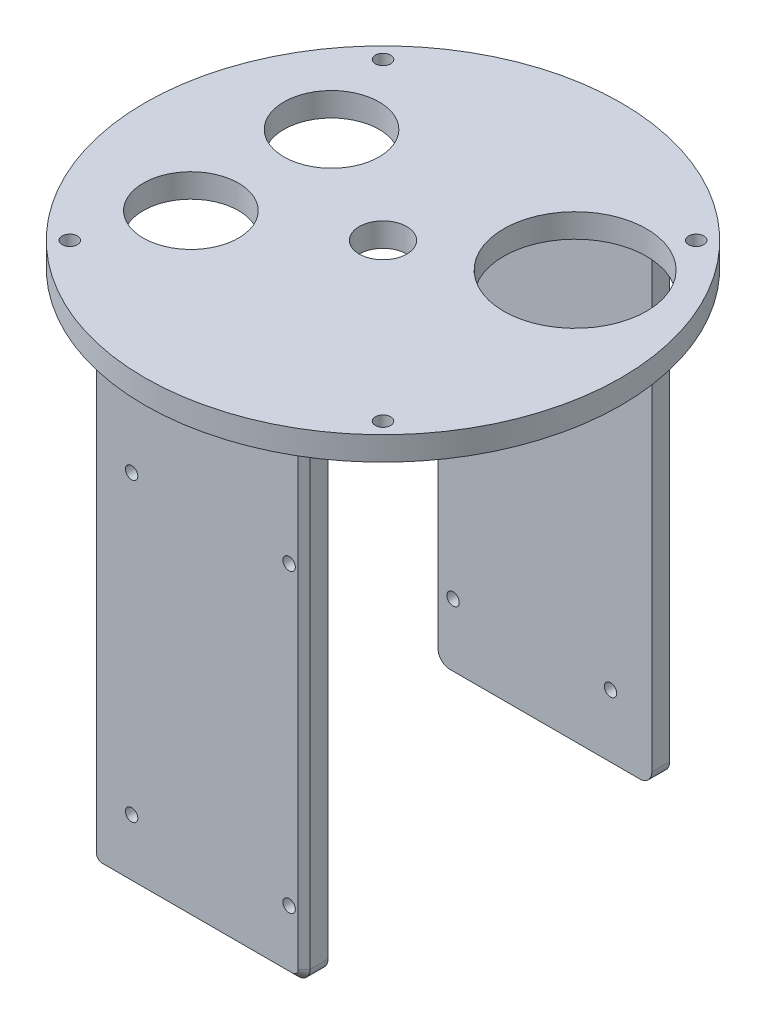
ISO-10303-21;
HEADER;
FILE_DESCRIPTION(('STEP AP214'),'2;1');
FILE_NAME('part.step','',(''),(''),'','','');
FILE_SCHEMA(('AUTOMOTIVE_DESIGN { 1 0 10303 214 1 1 1 1 }'));
ENDSEC;
DATA;
#1=APPLICATION_CONTEXT('core data for automotive mechanical design processes');
#2=APPLICATION_PROTOCOL_DEFINITION('international standard','automotive_design',2000,#1);
#3=PRODUCT_CONTEXT('',#1,'mechanical');
#4=PRODUCT('Part','Part','',(#3));
#5=PRODUCT_RELATED_PRODUCT_CATEGORY('part','',(#4));
#6=PRODUCT_DEFINITION_FORMATION('','',#4);
#7=PRODUCT_DEFINITION_CONTEXT('part definition',#1,'design');
#8=PRODUCT_DEFINITION('design','',#6,#7);
#9=PRODUCT_DEFINITION_SHAPE('','',#8);
#10=(LENGTH_UNIT() NAMED_UNIT(*) SI_UNIT(.MILLI.,.METRE.));
#11=(NAMED_UNIT(*) PLANE_ANGLE_UNIT() SI_UNIT($,.RADIAN.));
#12=(NAMED_UNIT(*) SI_UNIT($,.STERADIAN.) SOLID_ANGLE_UNIT());
#13=UNCERTAINTY_MEASURE_WITH_UNIT(LENGTH_MEASURE(1.E-05),#10,'distance_accuracy_value','');
#14=(GEOMETRIC_REPRESENTATION_CONTEXT(3) GLOBAL_UNCERTAINTY_ASSIGNED_CONTEXT((#13)) GLOBAL_UNIT_ASSIGNED_CONTEXT((#10,
#11,#12)) REPRESENTATION_CONTEXT('',''));
#15=CARTESIAN_POINT('',(0.,0.,0.));
#16=DIRECTION('',(0.,0.,1.));
#17=DIRECTION('',(1.,0.,0.));
#18=AXIS2_PLACEMENT_3D('',#15,#16,#17);
#19=CARTESIAN_POINT('',(32.5538959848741,73.8599908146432,103.618976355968));
#20=DIRECTION('',(0.,1.,0.));
#21=DIRECTION('',(0.,0.,1.));
#22=AXIS2_PLACEMENT_3D('',#19,#20,#21);
#23=PLANE('',#22);
#24=CARTESIAN_POINT('',(32.5538959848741,73.8599908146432,103.618976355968));
#25=DIRECTION('',(0.,1.,0.));
#26=DIRECTION('',(0.,0.,1.));
#27=AXIS2_PLACEMENT_3D('',#24,#25,#26);
#28=CIRCLE('',#27,6.35);
#29=CARTESIAN_POINT('',(32.5538959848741,73.8599908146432,109.968976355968));
#30=VERTEX_POINT('',#29);
#31=EDGE_CURVE('P0_E69',#30,#30,#28,.T.);
#32=ORIENTED_EDGE('',*,*,#31,.F.);
#33=EDGE_LOOP('',(#32));
#34=FACE_BOUND('',#33,.T.);
#35=CARTESIAN_POINT('',(0.0779433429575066,73.8599908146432,122.368976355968));
#36=DIRECTION('',(0.,1.,0.));
#37=DIRECTION('',(0.,0.,1.));
#38=AXIS2_PLACEMENT_3D('',#35,#36,#37);
#39=CIRCLE('',#38,12.7);
#40=CARTESIAN_POINT('',(0.0779433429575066,73.8599908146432,135.068976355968));
#41=VERTEX_POINT('',#40);
#42=EDGE_CURVE('P0_E37',#41,#41,#39,.T.);
#43=ORIENTED_EDGE('',*,*,#42,.F.);
#44=EDGE_LOOP('',(#43));
#45=FACE_BOUND('',#44,.T.);
#46=CARTESIAN_POINT('',(65.0298486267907,73.8599908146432,84.8689763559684));
#47=DIRECTION('',(0.,1.,0.));
#48=DIRECTION('',(0.,0.,1.));
#49=AXIS2_PLACEMENT_3D('',#46,#47,#48);
#50=CIRCLE('',#49,19.05);
#51=CARTESIAN_POINT('',(65.0298486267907,73.8599908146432,103.918976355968));
#52=VERTEX_POINT('',#51);
#53=EDGE_CURVE('P0_E36',#52,#52,#50,.T.);
#54=ORIENTED_EDGE('',*,*,#53,.F.);
#55=EDGE_LOOP('',(#54));
#56=FACE_BOUND('',#55,.T.);
#57=CARTESIAN_POINT('',(0.0779433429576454,73.8599908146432,84.8689763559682));
#58=DIRECTION('',(0.,1.,0.));
#59=DIRECTION('',(0.,0.,1.));
#60=AXIS2_PLACEMENT_3D('',#57,#58,#59);
#61=CIRCLE('',#60,12.7);
#62=CARTESIAN_POINT('',(0.0779433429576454,73.8599908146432,97.5689763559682));
#63=VERTEX_POINT('',#62);
#64=EDGE_CURVE('P0_E30',#63,#63,#61,.T.);
#65=ORIENTED_EDGE('',*,*,#64,.F.);
#66=EDGE_LOOP('',(#65));
#67=FACE_BOUND('',#66,.T.);
#68=CARTESIAN_POINT('',(74.3120869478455,73.8599908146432,145.37716731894));
#69=DIRECTION('',(0.,1.,0.));
#70=DIRECTION('',(0.,0.,1.));
#71=AXIS2_PLACEMENT_3D('',#68,#69,#70);
#72=CIRCLE('',#71,2.032);
#73=CARTESIAN_POINT('',(74.3120869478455,73.8599908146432,147.40916731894));
#74=VERTEX_POINT('',#73);
#75=EDGE_CURVE('P0_E48',#74,#74,#72,.T.);
#76=ORIENTED_EDGE('',*,*,#75,.F.);
#77=EDGE_LOOP('',(#76));
#78=FACE_BOUND('',#77,.T.);
#79=CARTESIAN_POINT('',(-9.20429497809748,73.8599908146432,61.8607853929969));
#80=DIRECTION('',(0.,-1.,0.));
#81=DIRECTION('',(0.,0.,-1.));
#82=AXIS2_PLACEMENT_3D('',#79,#80,#81);
#83=CIRCLE('',#82,2.032);
#84=CARTESIAN_POINT('',(-9.20429497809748,73.8599908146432,59.8287853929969));
#85=VERTEX_POINT('',#84);
#86=EDGE_CURVE('P0_E54',#85,#85,#83,.T.);
#87=ORIENTED_EDGE('',*,*,#86,.T.);
#88=EDGE_LOOP('',(#87));
#89=FACE_BOUND('',#88,.T.);
#90=CARTESIAN_POINT('',(74.3120869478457,73.8599908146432,61.8607853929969));
#91=DIRECTION('',(0.,1.,0.));
#92=DIRECTION('',(0.,0.,1.));
#93=AXIS2_PLACEMENT_3D('',#90,#91,#92);
#94=CIRCLE('',#93,2.032);
#95=CARTESIAN_POINT('',(74.3120869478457,73.8599908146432,63.8927853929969));
#96=VERTEX_POINT('',#95);
#97=EDGE_CURVE('P0_E27',#96,#96,#94,.T.);
#98=ORIENTED_EDGE('',*,*,#97,.F.);
#99=EDGE_LOOP('',(#98));
#100=FACE_BOUND('',#99,.T.);
#101=CARTESIAN_POINT('',(32.5538959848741,73.8599908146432,103.618976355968));
#102=DIRECTION('',(0.,1.,0.));
#103=DIRECTION('',(0.,0.,1.));
#104=AXIS2_PLACEMENT_3D('',#101,#102,#103);
#105=CIRCLE('',#104,63.5);
#106=CARTESIAN_POINT('',(32.5538959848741,73.8599908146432,167.118976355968));
#107=VERTEX_POINT('',#106);
#108=EDGE_CURVE('P0_E10',#107,#107,#105,.T.);
#109=ORIENTED_EDGE('',*,*,#108,.T.);
#110=EDGE_LOOP('',(#109));
#111=FACE_BOUND('',#110,.T.);
#112=CARTESIAN_POINT('',(-9.20429497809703,73.8599908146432,145.37716731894));
#113=DIRECTION('',(0.,1.,0.));
#114=DIRECTION('',(0.,0.,1.));
#115=AXIS2_PLACEMENT_3D('',#112,#113,#114);
#116=CIRCLE('',#115,2.03199999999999);
#117=CARTESIAN_POINT('',(-9.20429497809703,73.8599908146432,147.40916731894));
#118=VERTEX_POINT('',#117);
#119=EDGE_CURVE('P0_E61',#118,#118,#116,.F.);
#120=ORIENTED_EDGE('',*,*,#119,.T.);
#121=EDGE_LOOP('',(#120));
#122=FACE_BOUND('',#121,.T.);
#123=ADVANCED_FACE('P0_F14',(#34,#45,#56,#67,#78,#89,#100,#111,#122),#23,.T.);
#124=CARTESIAN_POINT('',(32.5538959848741,67.5099908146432,103.618976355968));
#125=DIRECTION('',(0.,1.,0.));
#126=DIRECTION('',(0.,0.,1.));
#127=AXIS2_PLACEMENT_3D('',#124,#125,#126);
#128=PLANE('',#127);
#129=CARTESIAN_POINT('',(32.5538959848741,67.5099908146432,103.618976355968));
#130=DIRECTION('',(0.,1.,0.));
#131=DIRECTION('',(0.,0.,1.));
#132=AXIS2_PLACEMENT_3D('',#129,#130,#131);
#133=CIRCLE('',#132,6.35);
#134=CARTESIAN_POINT('',(32.5538959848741,67.5099908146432,109.968976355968));
#135=VERTEX_POINT('',#134);
#136=EDGE_CURVE('P0_E55',#135,#135,#133,.T.);
#137=ORIENTED_EDGE('',*,*,#136,.T.);
#138=EDGE_LOOP('',(#137));
#139=FACE_BOUND('',#138,.T.);
#140=CARTESIAN_POINT('',(0.0779433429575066,67.5099908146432,122.368976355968));
#141=DIRECTION('',(0.,1.,0.));
#142=DIRECTION('',(0.,0.,1.));
#143=AXIS2_PLACEMENT_3D('',#140,#141,#142);
#144=CIRCLE('',#143,12.7);
#145=CARTESIAN_POINT('',(0.0779433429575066,67.5099908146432,135.068976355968));
#146=VERTEX_POINT('',#145);
#147=EDGE_CURVE('P0_E45',#146,#146,#144,.T.);
#148=ORIENTED_EDGE('',*,*,#147,.T.);
#149=EDGE_LOOP('',(#148));
#150=FACE_BOUND('',#149,.T.);
#151=CARTESIAN_POINT('',(65.0298486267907,67.5099908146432,84.8689763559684));
#152=DIRECTION('',(0.,1.,0.));
#153=DIRECTION('',(0.,0.,1.));
#154=AXIS2_PLACEMENT_3D('',#151,#152,#153);
#155=CIRCLE('',#154,19.05);
#156=CARTESIAN_POINT('',(65.0298486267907,67.5099908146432,103.918976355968));
#157=VERTEX_POINT('',#156);
#158=EDGE_CURVE('P0_E33',#157,#157,#155,.T.);
#159=ORIENTED_EDGE('',*,*,#158,.T.);
#160=EDGE_LOOP('',(#159));
#161=FACE_BOUND('',#160,.T.);
#162=CARTESIAN_POINT('',(0.0779433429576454,67.5099908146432,84.8689763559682));
#163=DIRECTION('',(0.,1.,0.));
#164=DIRECTION('',(0.,0.,1.));
#165=AXIS2_PLACEMENT_3D('',#162,#163,#164);
#166=CIRCLE('',#165,12.7);
#167=CARTESIAN_POINT('',(0.0779433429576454,67.5099908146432,97.5689763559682));
#168=VERTEX_POINT('',#167);
#169=EDGE_CURVE('P0_E40',#168,#168,#166,.T.);
#170=ORIENTED_EDGE('',*,*,#169,.T.);
#171=EDGE_LOOP('',(#170));
#172=FACE_BOUND('',#171,.T.);
#173=CARTESIAN_POINT('',(74.3120869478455,67.5099908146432,145.37716731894));
#174=DIRECTION('',(0.,1.,0.));
#175=DIRECTION('',(0.,0.,1.));
#176=AXIS2_PLACEMENT_3D('',#173,#174,#175);
#177=CIRCLE('',#176,2.032);
#178=CARTESIAN_POINT('',(74.3120869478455,67.5099908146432,147.40916731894));
#179=VERTEX_POINT('',#178);
#180=EDGE_CURVE('P0_E64',#179,#179,#177,.T.);
#181=ORIENTED_EDGE('',*,*,#180,.T.);
#182=EDGE_LOOP('',(#181));
#183=FACE_BOUND('',#182,.T.);
#184=CARTESIAN_POINT('',(74.3120869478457,67.5099908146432,61.8607853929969));
#185=DIRECTION('',(0.,1.,0.));
#186=DIRECTION('',(0.,0.,1.));
#187=AXIS2_PLACEMENT_3D('',#184,#185,#186);
#188=CIRCLE('',#187,2.032);
#189=CARTESIAN_POINT('',(74.3120869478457,67.5099908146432,63.8927853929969));
#190=VERTEX_POINT('',#189);
#191=EDGE_CURVE('P0_E25',#190,#190,#188,.T.);
#192=ORIENTED_EDGE('',*,*,#191,.T.);
#193=EDGE_LOOP('',(#192));
#194=FACE_BOUND('',#193,.T.);
#195=CARTESIAN_POINT('',(32.5538959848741,67.5099908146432,103.618976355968));
#196=DIRECTION('',(0.,1.,0.));
#197=DIRECTION('',(0.,0.,1.));
#198=AXIS2_PLACEMENT_3D('',#195,#196,#197);
#199=CIRCLE('',#198,63.5);
#200=CARTESIAN_POINT('',(32.5538959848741,67.5099908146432,167.118976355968));
#201=VERTEX_POINT('',#200);
#202=EDGE_CURVE('P0_E18',#201,#201,#199,.T.);
#203=ORIENTED_EDGE('',*,*,#202,.F.);
#204=EDGE_LOOP('',(#203));
#205=FACE_BOUND('',#204,.T.);
#206=CARTESIAN_POINT('',(-9.20429497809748,67.5099908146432,61.8607853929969));
#207=DIRECTION('',(0.,-1.,0.));
#208=DIRECTION('',(0.,0.,-1.));
#209=AXIS2_PLACEMENT_3D('',#206,#207,#208);
#210=CIRCLE('',#209,2.032);
#211=CARTESIAN_POINT('',(-9.20429497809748,67.5099908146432,59.8287853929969));
#212=VERTEX_POINT('',#211);
#213=EDGE_CURVE('P0_E51',#212,#212,#210,.T.);
#214=ORIENTED_EDGE('',*,*,#213,.F.);
#215=EDGE_LOOP('',(#214));
#216=FACE_BOUND('',#215,.T.);
#217=CARTESIAN_POINT('',(-9.20429497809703,67.5099908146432,145.37716731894));
#218=DIRECTION('',(0.,1.,0.));
#219=DIRECTION('',(0.,0.,1.));
#220=AXIS2_PLACEMENT_3D('',#217,#218,#219);
#221=CIRCLE('',#220,2.03199999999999);
#222=CARTESIAN_POINT('',(-9.20429497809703,67.5099908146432,147.40916731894));
#223=VERTEX_POINT('',#222);
#224=EDGE_CURVE('P0_E58',#223,#223,#221,.F.);
#225=ORIENTED_EDGE('',*,*,#224,.F.);
#226=EDGE_LOOP('',(#225));
#227=FACE_BOUND('',#226,.T.);
#228=ADVANCED_FACE('P0_F75',(#139,#150,#161,#172,#183,#194,#205,#216,#227),#128,.F.);
#229=CARTESIAN_POINT('',(32.5538959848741,73.8599908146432,103.618976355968));
#230=DIRECTION('',(0.,-1.,0.));
#231=DIRECTION('',(0.,0.,-1.));
#232=AXIS2_PLACEMENT_3D('',#229,#230,#231);
#233=CYLINDRICAL_SURFACE('',#232,63.5);
#234=ORIENTED_EDGE('',*,*,#108,.F.);
#235=EDGE_LOOP('',(#234));
#236=FACE_BOUND('',#235,.T.);
#237=ORIENTED_EDGE('',*,*,#202,.T.);
#238=EDGE_LOOP('',(#237));
#239=FACE_BOUND('',#238,.T.);
#240=ADVANCED_FACE('P0_F16',(#236,#239),#233,.T.);
#241=CARTESIAN_POINT('',(74.3120869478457,67.5099908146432,61.8607853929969));
#242=DIRECTION('',(0.,1.,0.));
#243=DIRECTION('',(0.,0.,1.));
#244=AXIS2_PLACEMENT_3D('',#241,#242,#243);
#245=CYLINDRICAL_SURFACE('',#244,2.032);
#246=ORIENTED_EDGE('',*,*,#191,.F.);
#247=EDGE_LOOP('',(#246));
#248=FACE_BOUND('',#247,.T.);
#249=ORIENTED_EDGE('',*,*,#97,.T.);
#250=EDGE_LOOP('',(#249));
#251=FACE_BOUND('',#250,.T.);
#252=ADVANCED_FACE('P0_F116',(#248,#251),#245,.F.);
#253=CARTESIAN_POINT('',(-9.20429497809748,67.5099908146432,61.8607853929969));
#254=DIRECTION('',(0.,1.,0.));
#255=DIRECTION('',(0.,0.,1.));
#256=AXIS2_PLACEMENT_3D('',#253,#254,#255);
#257=CYLINDRICAL_SURFACE('',#256,2.032);
#258=ORIENTED_EDGE('',*,*,#86,.F.);
#259=EDGE_LOOP('',(#258));
#260=FACE_BOUND('',#259,.T.);
#261=ORIENTED_EDGE('',*,*,#213,.T.);
#262=EDGE_LOOP('',(#261));
#263=FACE_BOUND('',#262,.T.);
#264=ADVANCED_FACE('P0_F105',(#260,#263),#257,.F.);
#265=CARTESIAN_POINT('',(-9.20429497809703,67.5099908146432,145.37716731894));
#266=DIRECTION('',(0.,1.,0.));
#267=DIRECTION('',(0.,0.,1.));
#268=AXIS2_PLACEMENT_3D('',#265,#266,#267);
#269=CYLINDRICAL_SURFACE('',#268,2.03199999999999);
#270=ORIENTED_EDGE('',*,*,#224,.T.);
#271=EDGE_LOOP('',(#270));
#272=FACE_BOUND('',#271,.T.);
#273=ORIENTED_EDGE('',*,*,#119,.F.);
#274=EDGE_LOOP('',(#273));
#275=FACE_BOUND('',#274,.T.);
#276=ADVANCED_FACE('P0_F102',(#272,#275),#269,.F.);
#277=CARTESIAN_POINT('',(74.3120869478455,67.5099908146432,145.37716731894));
#278=DIRECTION('',(0.,1.,0.));
#279=DIRECTION('',(0.,0.,1.));
#280=AXIS2_PLACEMENT_3D('',#277,#278,#279);
#281=CYLINDRICAL_SURFACE('',#280,2.032);
#282=ORIENTED_EDGE('',*,*,#180,.F.);
#283=EDGE_LOOP('',(#282));
#284=FACE_BOUND('',#283,.T.);
#285=ORIENTED_EDGE('',*,*,#75,.T.);
#286=EDGE_LOOP('',(#285));
#287=FACE_BOUND('',#286,.T.);
#288=ADVANCED_FACE('P0_F104',(#284,#287),#281,.F.);
#289=CARTESIAN_POINT('',(0.0779433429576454,67.5099908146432,84.8689763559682));
#290=DIRECTION('',(0.,1.,0.));
#291=DIRECTION('',(0.,0.,1.));
#292=AXIS2_PLACEMENT_3D('',#289,#290,#291);
#293=CYLINDRICAL_SURFACE('',#292,12.7);
#294=ORIENTED_EDGE('',*,*,#64,.T.);
#295=EDGE_LOOP('',(#294));
#296=FACE_BOUND('',#295,.T.);
#297=ORIENTED_EDGE('',*,*,#169,.F.);
#298=EDGE_LOOP('',(#297));
#299=FACE_BOUND('',#298,.T.);
#300=ADVANCED_FACE('P0_F113',(#296,#299),#293,.F.);
#301=CARTESIAN_POINT('',(65.0298486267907,67.5099908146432,84.8689763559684));
#302=DIRECTION('',(0.,1.,0.));
#303=DIRECTION('',(0.,0.,1.));
#304=AXIS2_PLACEMENT_3D('',#301,#302,#303);
#305=CYLINDRICAL_SURFACE('',#304,19.05);
#306=ORIENTED_EDGE('',*,*,#158,.F.);
#307=EDGE_LOOP('',(#306));
#308=FACE_BOUND('',#307,.T.);
#309=ORIENTED_EDGE('',*,*,#53,.T.);
#310=EDGE_LOOP('',(#309));
#311=FACE_BOUND('',#310,.T.);
#312=ADVANCED_FACE('P0_F122',(#308,#311),#305,.F.);
#313=CARTESIAN_POINT('',(0.0779433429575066,67.5099908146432,122.368976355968));
#314=DIRECTION('',(0.,1.,0.));
#315=DIRECTION('',(0.,0.,1.));
#316=AXIS2_PLACEMENT_3D('',#313,#314,#315);
#317=CYLINDRICAL_SURFACE('',#316,12.7);
#318=ORIENTED_EDGE('',*,*,#147,.F.);
#319=EDGE_LOOP('',(#318));
#320=FACE_BOUND('',#319,.T.);
#321=ORIENTED_EDGE('',*,*,#42,.T.);
#322=EDGE_LOOP('',(#321));
#323=FACE_BOUND('',#322,.T.);
#324=ADVANCED_FACE('P0_F81',(#320,#323),#317,.F.);
#325=CARTESIAN_POINT('',(32.5538959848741,67.5099908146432,103.618976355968));
#326=DIRECTION('',(0.,1.,0.));
#327=DIRECTION('',(0.,0.,1.));
#328=AXIS2_PLACEMENT_3D('',#325,#326,#327);
#329=CYLINDRICAL_SURFACE('',#328,6.35);
#330=ORIENTED_EDGE('',*,*,#136,.F.);
#331=EDGE_LOOP('',(#330));
#332=FACE_BOUND('',#331,.T.);
#333=ORIENTED_EDGE('',*,*,#31,.T.);
#334=EDGE_LOOP('',(#333));
#335=FACE_BOUND('',#334,.T.);
#336=ADVANCED_FACE('P0_F78',(#332,#335),#329,.F.);
#337=CLOSED_SHELL('',(#123,#228,#240,#252,#264,#276,#288,#300,#312,#324,#336));
#338=MANIFOLD_SOLID_BREP('P0_B1',#337);
#339=CARTESIAN_POINT('',(4.05509598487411,67.5099908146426,153.148976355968));
#340=DIRECTION('',(0.,-1.,0.));
#341=DIRECTION('',(1.,0.,0.));
#342=AXIS2_PLACEMENT_3D('',#339,#340,#341);
#343=PLANE('',#342);
#344=DIRECTION('',(-1.,0.,0.));
#345=VECTOR('',#344,1.);
#346=CARTESIAN_POINT('',(4.05509598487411,67.5099908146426,153.148976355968));
#347=LINE('',#346,#345);
#348=CARTESIAN_POINT('',(59.4651959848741,67.5099908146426,153.148976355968));
#349=VERTEX_POINT('',#348);
#350=CARTESIAN_POINT('',(5.6425959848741,67.5099908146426,153.148976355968));
#351=VERTEX_POINT('',#350);
#352=EDGE_CURVE('P1_E117',#349,#351,#347,.T.);
#353=ORIENTED_EDGE('',*,*,#352,.F.);
#354=DIRECTION('',(-0.707106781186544,0.,0.707106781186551));
#355=VECTOR('',#354,1.);
#356=CARTESIAN_POINT('',(59.4651959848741,67.5099908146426,153.148976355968));
#357=LINE('',#356,#355);
#358=CARTESIAN_POINT('',(61.0526959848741,67.5099908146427,151.561476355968));
#359=VERTEX_POINT('',#358);
#360=EDGE_CURVE('P1_E148',#349,#359,#357,.F.);
#361=ORIENTED_EDGE('',*,*,#360,.T.);
#362=DIRECTION('',(0.,0.,-1.));
#363=VECTOR('',#362,1.);
#364=CARTESIAN_POINT('',(61.0526959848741,67.5099908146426,153.148976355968));
#365=LINE('',#364,#363);
#366=CARTESIAN_POINT('',(61.0526959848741,67.5099908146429,146.798976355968));
#367=VERTEX_POINT('',#366);
#368=EDGE_CURVE('P1_E98',#359,#367,#365,.T.);
#369=ORIENTED_EDGE('',*,*,#368,.T.);
#370=DIRECTION('',(-1.,0.,0.));
#371=VECTOR('',#370,1.);
#372=CARTESIAN_POINT('',(4.05509598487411,67.5099908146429,146.798976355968));
#373=LINE('',#372,#371);
#374=CARTESIAN_POINT('',(4.05509598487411,67.5099908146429,146.798976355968));
#375=VERTEX_POINT('',#374);
#376=EDGE_CURVE('P1_E104',#367,#375,#373,.T.);
#377=ORIENTED_EDGE('',*,*,#376,.T.);
#378=DIRECTION('',(0.,0.,-1.));
#379=VECTOR('',#378,1.);
#380=CARTESIAN_POINT('',(4.05509598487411,67.5099908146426,153.148976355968));
#381=LINE('',#380,#379);
#382=CARTESIAN_POINT('',(4.05509598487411,67.5099908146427,151.561476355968));
#383=VERTEX_POINT('',#382);
#384=EDGE_CURVE('P1_E89',#383,#375,#381,.T.);
#385=ORIENTED_EDGE('',*,*,#384,.F.);
#386=DIRECTION('',(-0.707106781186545,0.,-0.707106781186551));
#387=VECTOR('',#386,1.);
#388=CARTESIAN_POINT('',(5.6425959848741,67.5099908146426,153.148976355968));
#389=LINE('',#388,#387);
#390=EDGE_CURVE('P1_E146',#383,#351,#389,.F.);
#391=ORIENTED_EDGE('',*,*,#390,.T.);
#392=EDGE_LOOP('',(#353,#361,#369,#377,#385,#391));
#393=FACE_BOUND('',#392,.T.);
#394=ADVANCED_FACE('P1_F16',(#393),#343,.F.);
#395=CARTESIAN_POINT('',(4.05509598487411,67.5099908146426,153.148976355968));
#396=DIRECTION('',(1.,0.,0.));
#397=DIRECTION('',(0.,1.,0.));
#398=AXIS2_PLACEMENT_3D('',#395,#396,#397);
#399=PLANE('',#398);
#400=DIRECTION('',(0.,0.,-1.));
#401=VECTOR('',#400,1.);
#402=CARTESIAN_POINT('',(4.05509598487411,-56.3150091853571,153.148976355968));
#403=LINE('',#402,#401);
#404=CARTESIAN_POINT('',(4.05509598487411,-56.3150091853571,146.798976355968));
#405=VERTEX_POINT('',#404);
#406=CARTESIAN_POINT('',(4.05509598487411,-56.3150091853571,151.561476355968));
#407=VERTEX_POINT('',#406);
#408=EDGE_CURVE('P1_E133',#405,#407,#403,.F.);
#409=ORIENTED_EDGE('',*,*,#408,.T.);
#410=DIRECTION('',(0.,1.,0.));
#411=VECTOR('',#410,1.);
#412=CARTESIAN_POINT('',(4.05509598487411,67.5099908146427,151.561476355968));
#413=LINE('',#412,#411);
#414=EDGE_CURVE('P1_E11',#407,#383,#413,.T.);
#415=ORIENTED_EDGE('',*,*,#414,.T.);
#416=ORIENTED_EDGE('',*,*,#384,.T.);
#417=DIRECTION('',(0.,-1.,0.));
#418=VECTOR('',#417,1.);
#419=CARTESIAN_POINT('',(4.05509598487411,67.5099908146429,146.798976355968));
#420=LINE('',#419,#418);
#421=EDGE_CURVE('P1_E92',#375,#405,#420,.T.);
#422=ORIENTED_EDGE('',*,*,#421,.T.);
#423=EDGE_LOOP('',(#409,#415,#416,#422));
#424=FACE_BOUND('',#423,.T.);
#425=ADVANCED_FACE('P1_F91',(#424),#399,.F.);
#426=CARTESIAN_POINT('',(4.05509598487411,-59.4900091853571,153.148976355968));
#427=DIRECTION('',(0.,1.,0.));
#428=DIRECTION('',(-1.,0.,0.));
#429=AXIS2_PLACEMENT_3D('',#426,#427,#428);
#430=PLANE('',#429);
#431=DIRECTION('',(0.,0.,-1.));
#432=VECTOR('',#431,1.);
#433=CARTESIAN_POINT('',(57.8776959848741,-59.4900091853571,153.148976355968));
#434=LINE('',#433,#432);
#435=CARTESIAN_POINT('',(57.8776959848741,-59.4900091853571,146.798976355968));
#436=VERTEX_POINT('',#435);
#437=CARTESIAN_POINT('',(57.8776959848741,-59.4900091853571,151.561476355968));
#438=VERTEX_POINT('',#437);
#439=EDGE_CURVE('P1_E131',#436,#438,#434,.F.);
#440=ORIENTED_EDGE('',*,*,#439,.T.);
#441=DIRECTION('',(-1.,0.,0.));
#442=VECTOR('',#441,1.);
#443=CARTESIAN_POINT('',(4.05509598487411,-59.4900091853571,151.561476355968));
#444=LINE('',#443,#442);
#445=CARTESIAN_POINT('',(7.2300959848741,-59.4900091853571,151.561476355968));
#446=VERTEX_POINT('',#445);
#447=EDGE_CURVE('P1_E40',#438,#446,#444,.T.);
#448=ORIENTED_EDGE('',*,*,#447,.T.);
#449=DIRECTION('',(0.,0.,-1.));
#450=VECTOR('',#449,1.);
#451=CARTESIAN_POINT('',(7.23009598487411,-59.4900091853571,153.148976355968));
#452=LINE('',#451,#450);
#453=CARTESIAN_POINT('',(7.2300959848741,-59.4900091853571,146.798976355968));
#454=VERTEX_POINT('',#453);
#455=EDGE_CURVE('P1_E129',#446,#454,#452,.T.);
#456=ORIENTED_EDGE('',*,*,#455,.T.);
#457=DIRECTION('',(1.,0.,0.));
#458=VECTOR('',#457,1.);
#459=CARTESIAN_POINT('',(4.05509598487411,-59.4900091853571,146.798976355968));
#460=LINE('',#459,#458);
#461=EDGE_CURVE('P1_E108',#454,#436,#460,.T.);
#462=ORIENTED_EDGE('',*,*,#461,.T.);
#463=EDGE_LOOP('',(#440,#448,#456,#462));
#464=FACE_BOUND('',#463,.T.);
#465=ADVANCED_FACE('P1_F189',(#464),#430,.F.);
#466=CARTESIAN_POINT('',(61.0526959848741,67.5099908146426,153.148976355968));
#467=DIRECTION('',(-1.,0.,0.));
#468=DIRECTION('',(0.,-1.,0.));
#469=AXIS2_PLACEMENT_3D('',#466,#467,#468);
#470=PLANE('',#469);
#471=ORIENTED_EDGE('',*,*,#368,.F.);
#472=DIRECTION('',(0.,-1.,0.));
#473=VECTOR('',#472,1.);
#474=CARTESIAN_POINT('',(61.0526959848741,67.5099908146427,151.561476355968));
#475=LINE('',#474,#473);
#476=CARTESIAN_POINT('',(61.0526959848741,-56.3150091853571,151.561476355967));
#477=VERTEX_POINT('',#476);
#478=EDGE_CURVE('P1_E150',#359,#477,#475,.T.);
#479=ORIENTED_EDGE('',*,*,#478,.T.);
#480=DIRECTION('',(0.,0.,-1.));
#481=VECTOR('',#480,1.);
#482=CARTESIAN_POINT('',(61.0526959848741,-56.3150091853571,153.148976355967));
#483=LINE('',#482,#481);
#484=CARTESIAN_POINT('',(61.0526959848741,-56.3150091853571,146.798976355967));
#485=VERTEX_POINT('',#484);
#486=EDGE_CURVE('P1_E97',#477,#485,#483,.T.);
#487=ORIENTED_EDGE('',*,*,#486,.T.);
#488=DIRECTION('',(0.,1.,0.));
#489=VECTOR('',#488,1.);
#490=CARTESIAN_POINT('',(61.0526959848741,67.5099908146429,146.798976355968));
#491=LINE('',#490,#489);
#492=EDGE_CURVE('P1_E122',#485,#367,#491,.T.);
#493=ORIENTED_EDGE('',*,*,#492,.T.);
#494=EDGE_LOOP('',(#471,#479,#487,#493));
#495=FACE_BOUND('',#494,.T.);
#496=ADVANCED_FACE('P1_F184',(#495),#470,.F.);
#497=CARTESIAN_POINT('',(4.05509598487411,67.5099908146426,153.148976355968));
#498=DIRECTION('',(0.,0.,-1.));
#499=DIRECTION('',(1.,0.,0.));
#500=AXIS2_PLACEMENT_3D('',#497,#498,#499);
#501=PLANE('',#500);
#502=CARTESIAN_POINT('',(57.0526963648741,36.2099899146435,153.148976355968));
#503=DIRECTION('',(0.,0.,1.));
#504=DIRECTION('',(0.,1.,0.));
#505=AXIS2_PLACEMENT_3D('',#502,#503,#504);
#506=CIRCLE('',#505,1.651);
#507=CARTESIAN_POINT('',(57.0526963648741,37.8609899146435,153.148976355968));
#508=VERTEX_POINT('',#507);
#509=EDGE_CURVE('P1_E366',#508,#508,#506,.T.);
#510=ORIENTED_EDGE('',*,*,#509,.F.);
#511=EDGE_LOOP('',(#510));
#512=FACE_BOUND('',#511,.T.);
#513=CARTESIAN_POINT('',(15.0526965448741,36.209989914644,153.148976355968));
#514=DIRECTION('',(0.,0.,1.));
#515=DIRECTION('',(0.,1.,0.));
#516=AXIS2_PLACEMENT_3D('',#513,#514,#515);
#517=CIRCLE('',#516,1.65100000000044);
#518=CARTESIAN_POINT('',(15.0526965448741,37.8609899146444,153.148976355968));
#519=VERTEX_POINT('',#518);
#520=EDGE_CURVE('P1_E370',#519,#519,#517,.T.);
#521=ORIENTED_EDGE('',*,*,#520,.F.);
#522=EDGE_LOOP('',(#521));
#523=FACE_BOUND('',#522,.T.);
#524=CARTESIAN_POINT('',(15.0526965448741,-42.7900095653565,153.148976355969));
#525=DIRECTION('',(0.,0.,1.));
#526=DIRECTION('',(0.,1.,0.));
#527=AXIS2_PLACEMENT_3D('',#524,#525,#526);
#528=CIRCLE('',#527,1.65100000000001);
#529=CARTESIAN_POINT('',(15.0526965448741,-41.1390095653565,153.148976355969));
#530=VERTEX_POINT('',#529);
#531=EDGE_CURVE('P1_E374',#530,#530,#528,.T.);
#532=ORIENTED_EDGE('',*,*,#531,.F.);
#533=EDGE_LOOP('',(#532));
#534=FACE_BOUND('',#533,.T.);
#535=CARTESIAN_POINT('',(57.0526963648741,-42.7900095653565,153.148976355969));
#536=DIRECTION('',(0.,0.,1.));
#537=DIRECTION('',(0.,1.,0.));
#538=AXIS2_PLACEMENT_3D('',#535,#536,#537);
#539=CIRCLE('',#538,1.65100000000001);
#540=CARTESIAN_POINT('',(57.0526963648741,-41.1390095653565,153.148976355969));
#541=VERTEX_POINT('',#540);
#542=EDGE_CURVE('P1_E362',#541,#541,#539,.T.);
#543=ORIENTED_EDGE('',*,*,#542,.F.);
#544=EDGE_LOOP('',(#543));
#545=FACE_BOUND('',#544,.T.);
#546=CARTESIAN_POINT('',(57.8776959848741,-56.3150091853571,153.148976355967));
#547=DIRECTION('',(0.,0.,-1.));
#548=DIRECTION('',(1.,0.,0.));
#549=AXIS2_PLACEMENT_3D('',#546,#547,#548);
#550=CIRCLE('',#549,1.58750000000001);
#551=CARTESIAN_POINT('',(57.8776959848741,-57.9025091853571,153.148976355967));
#552=VERTEX_POINT('',#551);
#553=CARTESIAN_POINT('',(59.4651959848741,-56.3150091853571,153.148976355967));
#554=VERTEX_POINT('',#553);
#555=EDGE_CURVE('P1_E141',#552,#554,#550,.F.);
#556=ORIENTED_EDGE('',*,*,#555,.T.);
#557=DIRECTION('',(0.,1.,0.));
#558=VECTOR('',#557,1.);
#559=CARTESIAN_POINT('',(59.4651959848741,67.5099908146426,153.148976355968));
#560=LINE('',#559,#558);
#561=EDGE_CURVE('P1_E143',#554,#349,#560,.T.);
#562=ORIENTED_EDGE('',*,*,#561,.T.);
#563=ORIENTED_EDGE('',*,*,#352,.T.);
#564=DIRECTION('',(0.,-1.,0.));
#565=VECTOR('',#564,1.);
#566=CARTESIAN_POINT('',(5.6425959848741,67.5099908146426,153.148976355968));
#567=LINE('',#566,#565);
#568=CARTESIAN_POINT('',(5.6425959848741,-56.3150091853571,153.148976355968));
#569=VERTEX_POINT('',#568);
#570=EDGE_CURVE('P1_E135',#351,#569,#567,.T.);
#571=ORIENTED_EDGE('',*,*,#570,.T.);
#572=CARTESIAN_POINT('',(7.23009598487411,-56.3150091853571,153.148976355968));
#573=DIRECTION('',(0.,0.,-1.));
#574=DIRECTION('',(1.,0.,0.));
#575=AXIS2_PLACEMENT_3D('',#572,#573,#574);
#576=CIRCLE('',#575,1.58750000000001);
#577=CARTESIAN_POINT('',(7.23009598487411,-57.9025091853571,153.148976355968));
#578=VERTEX_POINT('',#577);
#579=EDGE_CURVE('P1_E137',#569,#578,#576,.F.);
#580=ORIENTED_EDGE('',*,*,#579,.T.);
#581=DIRECTION('',(1.,0.,0.));
#582=VECTOR('',#581,1.);
#583=CARTESIAN_POINT('',(4.05509598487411,-57.9025091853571,153.148976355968));
#584=LINE('',#583,#582);
#585=EDGE_CURVE('P1_E139',#578,#552,#584,.T.);
#586=ORIENTED_EDGE('',*,*,#585,.T.);
#587=EDGE_LOOP('',(#556,#562,#563,#571,#580,#586));
#588=FACE_BOUND('',#587,.T.);
#589=ADVANCED_FACE('P1_F176',(#512,#523,#534,#545,#588),#501,.F.);
#590=CARTESIAN_POINT('',(4.05509598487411,67.5099908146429,146.798976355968));
#591=DIRECTION('',(0.,0.,-1.));
#592=DIRECTION('',(1.,0.,0.));
#593=AXIS2_PLACEMENT_3D('',#590,#591,#592);
#594=PLANE('',#593);
#595=CARTESIAN_POINT('',(57.0526963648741,36.2099899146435,146.798976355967));
#596=DIRECTION('',(0.,0.,1.));
#597=DIRECTION('',(0.,1.,0.));
#598=AXIS2_PLACEMENT_3D('',#595,#596,#597);
#599=CIRCLE('',#598,1.651);
#600=CARTESIAN_POINT('',(57.0526963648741,37.8609899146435,146.798976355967));
#601=VERTEX_POINT('',#600);
#602=EDGE_CURVE('P1_E351',#601,#601,#599,.T.);
#603=ORIENTED_EDGE('',*,*,#602,.T.);
#604=EDGE_LOOP('',(#603));
#605=FACE_BOUND('',#604,.T.);
#606=CARTESIAN_POINT('',(15.0526965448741,36.2099899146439,146.798976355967));
#607=DIRECTION('',(0.,0.,1.));
#608=DIRECTION('',(0.,1.,0.));
#609=AXIS2_PLACEMENT_3D('',#606,#607,#608);
#610=CIRCLE('',#609,1.65100000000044);
#611=CARTESIAN_POINT('',(15.0526965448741,37.8609899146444,146.798976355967));
#612=VERTEX_POINT('',#611);
#613=EDGE_CURVE('P1_E355',#612,#612,#610,.T.);
#614=ORIENTED_EDGE('',*,*,#613,.T.);
#615=EDGE_LOOP('',(#614));
#616=FACE_BOUND('',#615,.T.);
#617=CARTESIAN_POINT('',(15.0526965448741,-42.7900095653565,146.798976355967));
#618=DIRECTION('',(0.,0.,1.));
#619=DIRECTION('',(0.,1.,0.));
#620=AXIS2_PLACEMENT_3D('',#617,#618,#619);
#621=CIRCLE('',#620,1.65100000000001);
#622=CARTESIAN_POINT('',(15.0526965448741,-41.1390095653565,146.798976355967));
#623=VERTEX_POINT('',#622);
#624=EDGE_CURVE('P1_E359',#623,#623,#621,.T.);
#625=ORIENTED_EDGE('',*,*,#624,.T.);
#626=EDGE_LOOP('',(#625));
#627=FACE_BOUND('',#626,.T.);
#628=CARTESIAN_POINT('',(57.0526963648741,-42.7900095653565,146.798976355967));
#629=DIRECTION('',(0.,0.,1.));
#630=DIRECTION('',(0.,1.,0.));
#631=AXIS2_PLACEMENT_3D('',#628,#629,#630);
#632=CIRCLE('',#631,1.65100000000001);
#633=CARTESIAN_POINT('',(57.0526963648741,-41.1390095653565,146.798976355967));
#634=VERTEX_POINT('',#633);
#635=EDGE_CURVE('P1_E160',#634,#634,#632,.T.);
#636=ORIENTED_EDGE('',*,*,#635,.T.);
#637=EDGE_LOOP('',(#636));
#638=FACE_BOUND('',#637,.T.);
#639=ORIENTED_EDGE('',*,*,#492,.F.);
#640=CARTESIAN_POINT('',(57.8776959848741,-56.3150091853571,146.798976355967));
#641=DIRECTION('',(0.,0.,-1.));
#642=DIRECTION('',(1.,0.,0.));
#643=AXIS2_PLACEMENT_3D('',#640,#641,#642);
#644=CIRCLE('',#643,3.175);
#645=EDGE_CURVE('P1_E127',#485,#436,#644,.T.);
#646=ORIENTED_EDGE('',*,*,#645,.T.);
#647=ORIENTED_EDGE('',*,*,#461,.F.);
#648=CARTESIAN_POINT('',(7.2300959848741,-56.3150091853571,146.798976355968));
#649=DIRECTION('',(0.,0.,-1.));
#650=DIRECTION('',(1.,0.,0.));
#651=AXIS2_PLACEMENT_3D('',#648,#649,#650);
#652=CIRCLE('',#651,3.175);
#653=EDGE_CURVE('P1_E107',#454,#405,#652,.T.);
#654=ORIENTED_EDGE('',*,*,#653,.T.);
#655=ORIENTED_EDGE('',*,*,#421,.F.);
#656=ORIENTED_EDGE('',*,*,#376,.F.);
#657=EDGE_LOOP('',(#639,#646,#647,#654,#655,#656));
#658=FACE_BOUND('',#657,.T.);
#659=ADVANCED_FACE('P1_F103',(#605,#616,#627,#638,#658),#594,.T.);
#660=CARTESIAN_POINT('',(57.8776959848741,-56.3150091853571,153.148976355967));
#661=DIRECTION('',(0.,0.,-1.));
#662=DIRECTION('',(1.,0.,0.));
#663=AXIS2_PLACEMENT_3D('',#660,#661,#662);
#664=CYLINDRICAL_SURFACE('',#663,3.175);
#665=ORIENTED_EDGE('',*,*,#486,.F.);
#666=CARTESIAN_POINT('',(57.8776959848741,-56.3150091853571,151.561476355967));
#667=DIRECTION('',(0.,0.,-1.));
#668=DIRECTION('',(1.,0.,0.));
#669=AXIS2_PLACEMENT_3D('',#666,#667,#668);
#670=CIRCLE('',#669,3.175);
#671=EDGE_CURVE('P1_E152',#477,#438,#670,.T.);
#672=ORIENTED_EDGE('',*,*,#671,.T.);
#673=ORIENTED_EDGE('',*,*,#439,.F.);
#674=ORIENTED_EDGE('',*,*,#645,.F.);
#675=EDGE_LOOP('',(#665,#672,#673,#674));
#676=FACE_BOUND('',#675,.T.);
#677=ADVANCED_FACE('P1_F190',(#676),#664,.T.);
#678=CARTESIAN_POINT('',(7.23009598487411,-56.3150091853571,153.148976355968));
#679=DIRECTION('',(0.,0.,-1.));
#680=DIRECTION('',(1.,0.,0.));
#681=AXIS2_PLACEMENT_3D('',#678,#679,#680);
#682=CYLINDRICAL_SURFACE('',#681,3.175);
#683=ORIENTED_EDGE('',*,*,#455,.F.);
#684=CARTESIAN_POINT('',(7.2300959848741,-56.3150091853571,151.561476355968));
#685=DIRECTION('',(0.,0.,-1.));
#686=DIRECTION('',(1.,0.,0.));
#687=AXIS2_PLACEMENT_3D('',#684,#685,#686);
#688=CIRCLE('',#687,3.175);
#689=EDGE_CURVE('P1_E25',#446,#407,#688,.T.);
#690=ORIENTED_EDGE('',*,*,#689,.T.);
#691=ORIENTED_EDGE('',*,*,#408,.F.);
#692=ORIENTED_EDGE('',*,*,#653,.F.);
#693=EDGE_LOOP('',(#683,#690,#691,#692));
#694=FACE_BOUND('',#693,.T.);
#695=ADVANCED_FACE('P1_F214',(#694),#682,.T.);
#696=CARTESIAN_POINT('',(5.6425959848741,67.5099908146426,153.148976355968));
#697=DIRECTION('',(0.70710678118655,0.,-0.707106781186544));
#698=DIRECTION('',(0.,-1.,0.));
#699=AXIS2_PLACEMENT_3D('',#696,#697,#698);
#700=PLANE('',#699);
#701=ORIENTED_EDGE('',*,*,#390,.F.);
#702=ORIENTED_EDGE('',*,*,#414,.F.);
#703=DIRECTION('',(-0.707106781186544,0.,-0.70710678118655));
#704=VECTOR('',#703,1.);
#705=CARTESIAN_POINT('',(5.6425959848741,-56.3150091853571,153.148976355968));
#706=LINE('',#705,#704);
#707=EDGE_CURVE('P1_E20',#569,#407,#706,.T.);
#708=ORIENTED_EDGE('',*,*,#707,.F.);
#709=ORIENTED_EDGE('',*,*,#570,.F.);
#710=EDGE_LOOP('',(#701,#702,#708,#709));
#711=FACE_BOUND('',#710,.T.);
#712=ADVANCED_FACE('P1_F18',(#711),#700,.F.);
#713=CARTESIAN_POINT('',(7.23009598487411,-56.3150091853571,153.148976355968));
#714=DIRECTION('',(0.,0.,-1.));
#715=DIRECTION('',(1.,0.,0.));
#716=AXIS2_PLACEMENT_3D('',#713,#714,#715);
#717=CONICAL_SURFACE('',#716,1.58750000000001,0.785398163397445);
#718=ORIENTED_EDGE('',*,*,#707,.T.);
#719=ORIENTED_EDGE('',*,*,#689,.F.);
#720=DIRECTION('',(0.,-0.707106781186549,-0.707106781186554));
#721=VECTOR('',#720,1.);
#722=CARTESIAN_POINT('',(7.23009598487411,-57.9025091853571,153.148976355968));
#723=LINE('',#722,#721);
#724=EDGE_CURVE('P1_E115',#578,#446,#723,.T.);
#725=ORIENTED_EDGE('',*,*,#724,.F.);
#726=ORIENTED_EDGE('',*,*,#579,.F.);
#727=EDGE_LOOP('',(#718,#719,#725,#726));
#728=FACE_BOUND('',#727,.T.);
#729=ADVANCED_FACE('P1_F170',(#728),#717,.T.);
#730=CARTESIAN_POINT('',(4.05509598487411,-57.9025091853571,153.148976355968));
#731=DIRECTION('',(0.,0.707106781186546,-0.707106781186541));
#732=DIRECTION('',(1.,0.,0.));
#733=AXIS2_PLACEMENT_3D('',#730,#731,#732);
#734=PLANE('',#733);
#735=ORIENTED_EDGE('',*,*,#724,.T.);
#736=ORIENTED_EDGE('',*,*,#447,.F.);
#737=DIRECTION('',(0.,-0.707106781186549,-0.707106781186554));
#738=VECTOR('',#737,1.);
#739=CARTESIAN_POINT('',(57.8776959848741,-57.9025091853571,153.148976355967));
#740=LINE('',#739,#738);
#741=EDGE_CURVE('P1_E159',#552,#438,#740,.T.);
#742=ORIENTED_EDGE('',*,*,#741,.F.);
#743=ORIENTED_EDGE('',*,*,#585,.F.);
#744=EDGE_LOOP('',(#735,#736,#742,#743));
#745=FACE_BOUND('',#744,.T.);
#746=ADVANCED_FACE('P1_F166',(#745),#734,.F.);
#747=CARTESIAN_POINT('',(57.8776959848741,-56.3150091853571,153.148976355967));
#748=DIRECTION('',(0.,0.,-1.));
#749=DIRECTION('',(1.,0.,0.));
#750=AXIS2_PLACEMENT_3D('',#747,#748,#749);
#751=CONICAL_SURFACE('',#750,1.58750000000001,0.785398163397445);
#752=ORIENTED_EDGE('',*,*,#741,.T.);
#753=ORIENTED_EDGE('',*,*,#671,.F.);
#754=DIRECTION('',(0.707106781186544,0.,-0.707106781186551));
#755=VECTOR('',#754,1.);
#756=CARTESIAN_POINT('',(59.4651959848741,-56.3150091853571,153.148976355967));
#757=LINE('',#756,#755);
#758=EDGE_CURVE('P1_E156',#554,#477,#757,.T.);
#759=ORIENTED_EDGE('',*,*,#758,.F.);
#760=ORIENTED_EDGE('',*,*,#555,.F.);
#761=EDGE_LOOP('',(#752,#753,#759,#760));
#762=FACE_BOUND('',#761,.T.);
#763=ADVANCED_FACE('P1_F193',(#762),#751,.T.);
#764=CARTESIAN_POINT('',(59.4651959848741,67.5099908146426,153.148976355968));
#765=DIRECTION('',(-0.707106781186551,0.,-0.707106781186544));
#766=DIRECTION('',(0.,1.,0.));
#767=AXIS2_PLACEMENT_3D('',#764,#765,#766);
#768=PLANE('',#767);
#769=ORIENTED_EDGE('',*,*,#758,.T.);
#770=ORIENTED_EDGE('',*,*,#478,.F.);
#771=ORIENTED_EDGE('',*,*,#360,.F.);
#772=ORIENTED_EDGE('',*,*,#561,.F.);
#773=EDGE_LOOP('',(#769,#770,#771,#772));
#774=FACE_BOUND('',#773,.T.);
#775=ADVANCED_FACE('P1_F181',(#774),#768,.F.);
#776=CARTESIAN_POINT('',(57.0526963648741,-42.7900095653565,146.798976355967));
#777=DIRECTION('',(0.,0.,1.));
#778=DIRECTION('',(0.,1.,0.));
#779=AXIS2_PLACEMENT_3D('',#776,#777,#778);
#780=CYLINDRICAL_SURFACE('',#779,1.65100000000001);
#781=ORIENTED_EDGE('',*,*,#635,.F.);
#782=EDGE_LOOP('',(#781));
#783=FACE_BOUND('',#782,.T.);
#784=ORIENTED_EDGE('',*,*,#542,.T.);
#785=EDGE_LOOP('',(#784));
#786=FACE_BOUND('',#785,.T.);
#787=ADVANCED_FACE('P1_F201',(#783,#786),#780,.F.);
#788=CARTESIAN_POINT('',(15.0526965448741,-42.7900095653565,146.798976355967));
#789=DIRECTION('',(0.,0.,1.));
#790=DIRECTION('',(0.,1.,0.));
#791=AXIS2_PLACEMENT_3D('',#788,#789,#790);
#792=CYLINDRICAL_SURFACE('',#791,1.65100000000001);
#793=ORIENTED_EDGE('',*,*,#624,.F.);
#794=EDGE_LOOP('',(#793));
#795=FACE_BOUND('',#794,.T.);
#796=ORIENTED_EDGE('',*,*,#531,.T.);
#797=EDGE_LOOP('',(#796));
#798=FACE_BOUND('',#797,.T.);
#799=ADVANCED_FACE('P1_F255',(#795,#798),#792,.F.);
#800=CARTESIAN_POINT('',(15.0526965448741,36.2099899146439,146.798976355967));
#801=DIRECTION('',(0.,0.,1.));
#802=DIRECTION('',(0.,1.,0.));
#803=AXIS2_PLACEMENT_3D('',#800,#801,#802);
#804=CYLINDRICAL_SURFACE('',#803,1.65100000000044);
#805=ORIENTED_EDGE('',*,*,#613,.F.);
#806=EDGE_LOOP('',(#805));
#807=FACE_BOUND('',#806,.T.);
#808=ORIENTED_EDGE('',*,*,#520,.T.);
#809=EDGE_LOOP('',(#808));
#810=FACE_BOUND('',#809,.T.);
#811=ADVANCED_FACE('P1_F265',(#807,#810),#804,.F.);
#812=CARTESIAN_POINT('',(57.0526963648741,36.2099899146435,146.798976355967));
#813=DIRECTION('',(0.,0.,1.));
#814=DIRECTION('',(0.,1.,0.));
#815=AXIS2_PLACEMENT_3D('',#812,#813,#814);
#816=CYLINDRICAL_SURFACE('',#815,1.651);
#817=ORIENTED_EDGE('',*,*,#602,.F.);
#818=EDGE_LOOP('',(#817));
#819=FACE_BOUND('',#818,.T.);
#820=ORIENTED_EDGE('',*,*,#509,.T.);
#821=EDGE_LOOP('',(#820));
#822=FACE_BOUND('',#821,.T.);
#823=ADVANCED_FACE('P1_F275',(#819,#822),#816,.F.);
#824=CLOSED_SHELL('',(#394,#425,#465,#496,#589,#659,#677,#695,#712,#729,#746,#763,#775,#787,
#799,#811,#823));
#825=MANIFOLD_SOLID_BREP('P1_B1',#824);
#826=CARTESIAN_POINT('',(61.0526959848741,67.5099908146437,54.0889763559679));
#827=DIRECTION('',(0.,-1.,0.));
#828=DIRECTION('',(-1.,0.,0.));
#829=AXIS2_PLACEMENT_3D('',#826,#827,#828);
#830=PLANE('',#829);
#831=DIRECTION('',(1.,0.,0.));
#832=VECTOR('',#831,1.);
#833=CARTESIAN_POINT('',(61.0526959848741,67.5099908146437,54.0889763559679));
#834=LINE('',#833,#832);
#835=CARTESIAN_POINT('',(5.64259598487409,67.5099908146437,54.0889763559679));
#836=VERTEX_POINT('',#835);
#837=CARTESIAN_POINT('',(59.4651959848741,67.5099908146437,54.0889763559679));
#838=VERTEX_POINT('',#837);
#839=EDGE_CURVE('P2_E123',#836,#838,#834,.T.);
#840=ORIENTED_EDGE('',*,*,#839,.F.);
#841=DIRECTION('',(0.707106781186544,0.,-0.707106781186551));
#842=VECTOR('',#841,1.);
#843=CARTESIAN_POINT('',(5.64259598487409,67.5099908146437,54.0889763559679));
#844=LINE('',#843,#842);
#845=CARTESIAN_POINT('',(4.0550959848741,67.5099908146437,55.6764763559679));
#846=VERTEX_POINT('',#845);
#847=EDGE_CURVE('P2_E169',#836,#846,#844,.F.);
#848=ORIENTED_EDGE('',*,*,#847,.T.);
#849=DIRECTION('',(0.,0.,1.));
#850=VECTOR('',#849,1.);
#851=CARTESIAN_POINT('',(4.0550959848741,67.5099908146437,54.0889763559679));
#852=LINE('',#851,#850);
#853=CARTESIAN_POINT('',(4.0550959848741,67.509990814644,60.4389763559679));
#854=VERTEX_POINT('',#853);
#855=EDGE_CURVE('P2_E100',#846,#854,#852,.T.);
#856=ORIENTED_EDGE('',*,*,#855,.T.);
#857=DIRECTION('',(1.,0.,0.));
#858=VECTOR('',#857,1.);
#859=CARTESIAN_POINT('',(61.0526959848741,67.509990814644,60.4389763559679));
#860=LINE('',#859,#858);
#861=CARTESIAN_POINT('',(61.0526959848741,67.509990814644,60.4389763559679));
#862=VERTEX_POINT('',#861);
#863=EDGE_CURVE('P2_E106',#854,#862,#860,.T.);
#864=ORIENTED_EDGE('',*,*,#863,.T.);
#865=DIRECTION('',(0.,0.,1.));
#866=VECTOR('',#865,1.);
#867=CARTESIAN_POINT('',(61.0526959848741,67.5099908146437,54.0889763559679));
#868=LINE('',#867,#866);
#869=CARTESIAN_POINT('',(61.0526959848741,67.5099908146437,55.6764763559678));
#870=VERTEX_POINT('',#869);
#871=EDGE_CURVE('P2_E90',#870,#862,#868,.T.);
#872=ORIENTED_EDGE('',*,*,#871,.F.);
#873=DIRECTION('',(0.707106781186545,0.,0.707106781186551));
#874=VECTOR('',#873,1.);
#875=CARTESIAN_POINT('',(59.4651959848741,67.5099908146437,54.0889763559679));
#876=LINE('',#875,#874);
#877=EDGE_CURVE('P2_E166',#870,#838,#876,.F.);
#878=ORIENTED_EDGE('',*,*,#877,.T.);
#879=EDGE_LOOP('',(#840,#848,#856,#864,#872,#878));
#880=FACE_BOUND('',#879,.T.);
#881=ADVANCED_FACE('P2_F16',(#880),#830,.F.);
#882=CARTESIAN_POINT('',(61.0526959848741,67.5099908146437,54.0889763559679));
#883=DIRECTION('',(-1.,0.,0.));
#884=DIRECTION('',(0.,1.,0.));
#885=AXIS2_PLACEMENT_3D('',#882,#883,#884);
#886=PLANE('',#885);
#887=DIRECTION('',(0.,0.,1.));
#888=VECTOR('',#887,1.);
#889=CARTESIAN_POINT('',(61.0526959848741,-56.3150091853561,54.0889763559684));
#890=LINE('',#889,#888);
#891=CARTESIAN_POINT('',(61.0526959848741,-56.3150091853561,60.4389763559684));
#892=VERTEX_POINT('',#891);
#893=CARTESIAN_POINT('',(61.0526959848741,-56.3150091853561,55.6764763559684));
#894=VERTEX_POINT('',#893);
#895=EDGE_CURVE('P2_E147',#892,#894,#890,.F.);
#896=ORIENTED_EDGE('',*,*,#895,.T.);
#897=DIRECTION('',(0.,1.,0.));
#898=VECTOR('',#897,1.);
#899=CARTESIAN_POINT('',(61.0526959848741,67.5099908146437,55.6764763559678));
#900=LINE('',#899,#898);
#901=EDGE_CURVE('P2_E11',#894,#870,#900,.T.);
#902=ORIENTED_EDGE('',*,*,#901,.T.);
#903=ORIENTED_EDGE('',*,*,#871,.T.);
#904=DIRECTION('',(0.,-1.,0.));
#905=VECTOR('',#904,1.);
#906=CARTESIAN_POINT('',(61.0526959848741,67.509990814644,60.4389763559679));
#907=LINE('',#906,#905);
#908=EDGE_CURVE('P2_E93',#862,#892,#907,.T.);
#909=ORIENTED_EDGE('',*,*,#908,.T.);
#910=EDGE_LOOP('',(#896,#902,#903,#909));
#911=FACE_BOUND('',#910,.T.);
#912=ADVANCED_FACE('P2_F92',(#911),#886,.F.);
#913=CARTESIAN_POINT('',(61.0526959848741,-59.490009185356,54.0889763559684));
#914=DIRECTION('',(0.,1.,0.));
#915=DIRECTION('',(1.,0.,0.));
#916=AXIS2_PLACEMENT_3D('',#913,#914,#915);
#917=PLANE('',#916);
#918=DIRECTION('',(0.,0.,1.));
#919=VECTOR('',#918,1.);
#920=CARTESIAN_POINT('',(7.2300959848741,-59.490009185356,54.0889763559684));
#921=LINE('',#920,#919);
#922=CARTESIAN_POINT('',(7.2300959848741,-59.490009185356,60.4389763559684));
#923=VERTEX_POINT('',#922);
#924=CARTESIAN_POINT('',(7.2300959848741,-59.490009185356,55.6764763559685));
#925=VERTEX_POINT('',#924);
#926=EDGE_CURVE('P2_E144',#923,#925,#921,.F.);
#927=ORIENTED_EDGE('',*,*,#926,.T.);
#928=DIRECTION('',(1.,0.,0.));
#929=VECTOR('',#928,1.);
#930=CARTESIAN_POINT('',(61.0526959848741,-59.490009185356,55.6764763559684));
#931=LINE('',#930,#929);
#932=CARTESIAN_POINT('',(57.8776959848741,-59.490009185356,55.6764763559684));
#933=VERTEX_POINT('',#932);
#934=EDGE_CURVE('P2_E41',#925,#933,#931,.T.);
#935=ORIENTED_EDGE('',*,*,#934,.T.);
#936=DIRECTION('',(0.,0.,1.));
#937=VECTOR('',#936,1.);
#938=CARTESIAN_POINT('',(57.8776959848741,-59.490009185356,54.0889763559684));
#939=LINE('',#938,#937);
#940=CARTESIAN_POINT('',(57.8776959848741,-59.490009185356,60.4389763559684));
#941=VERTEX_POINT('',#940);
#942=EDGE_CURVE('P2_E141',#933,#941,#939,.T.);
#943=ORIENTED_EDGE('',*,*,#942,.T.);
#944=DIRECTION('',(-1.,0.,0.));
#945=VECTOR('',#944,1.);
#946=CARTESIAN_POINT('',(61.0526959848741,-59.490009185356,60.4389763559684));
#947=LINE('',#946,#945);
#948=EDGE_CURVE('P2_E111',#941,#923,#947,.T.);
#949=ORIENTED_EDGE('',*,*,#948,.T.);
#950=EDGE_LOOP('',(#927,#935,#943,#949));
#951=FACE_BOUND('',#950,.T.);
#952=ADVANCED_FACE('P2_F221',(#951),#917,.F.);
#953=CARTESIAN_POINT('',(4.0550959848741,67.5099908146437,54.0889763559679));
#954=DIRECTION('',(1.,0.,0.));
#955=DIRECTION('',(0.,-1.,0.));
#956=AXIS2_PLACEMENT_3D('',#953,#954,#955);
#957=PLANE('',#956);
#958=ORIENTED_EDGE('',*,*,#855,.F.);
#959=DIRECTION('',(0.,-1.,0.));
#960=VECTOR('',#959,1.);
#961=CARTESIAN_POINT('',(4.0550959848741,67.5099908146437,55.6764763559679));
#962=LINE('',#961,#960);
#963=CARTESIAN_POINT('',(4.0550959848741,-56.3150091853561,55.676476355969));
#964=VERTEX_POINT('',#963);
#965=EDGE_CURVE('P2_E172',#846,#964,#962,.T.);
#966=ORIENTED_EDGE('',*,*,#965,.T.);
#967=DIRECTION('',(0.,0.,1.));
#968=VECTOR('',#967,1.);
#969=CARTESIAN_POINT('',(4.0550959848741,-56.3150091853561,54.0889763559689));
#970=LINE('',#969,#968);
#971=CARTESIAN_POINT('',(4.0550959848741,-56.3150091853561,60.4389763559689));
#972=VERTEX_POINT('',#971);
#973=EDGE_CURVE('P2_E99',#964,#972,#970,.T.);
#974=ORIENTED_EDGE('',*,*,#973,.T.);
#975=DIRECTION('',(0.,1.,0.));
#976=VECTOR('',#975,1.);
#977=CARTESIAN_POINT('',(4.0550959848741,67.509990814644,60.4389763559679));
#978=LINE('',#977,#976);
#979=EDGE_CURVE('P2_E129',#972,#854,#978,.T.);
#980=ORIENTED_EDGE('',*,*,#979,.T.);
#981=EDGE_LOOP('',(#958,#966,#974,#980));
#982=FACE_BOUND('',#981,.T.);
#983=ADVANCED_FACE('P2_F216',(#982),#957,.F.);
#984=CARTESIAN_POINT('',(61.0526959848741,67.5099908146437,54.0889763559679));
#985=DIRECTION('',(0.,0.,1.));
#986=DIRECTION('',(-1.,0.,0.));
#987=AXIS2_PLACEMENT_3D('',#984,#985,#986);
#988=PLANE('',#987);
#989=CARTESIAN_POINT('',(8.05509560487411,36.2099899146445,54.0889763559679));
#990=DIRECTION('',(0.,0.,-1.));
#991=DIRECTION('',(0.,1.,0.));
#992=AXIS2_PLACEMENT_3D('',#989,#990,#991);
#993=CIRCLE('',#992,1.651);
#994=CARTESIAN_POINT('',(8.05509560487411,37.8609899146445,54.0889763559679));
#995=VERTEX_POINT('',#994);
#996=EDGE_CURVE('P2_E402',#995,#995,#993,.T.);
#997=ORIENTED_EDGE('',*,*,#996,.F.);
#998=EDGE_LOOP('',(#997));
#999=FACE_BOUND('',#998,.T.);
#1000=CARTESIAN_POINT('',(50.0550954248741,36.209989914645,54.0889763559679));
#1001=DIRECTION('',(0.,0.,-1.));
#1002=DIRECTION('',(0.,1.,0.));
#1003=AXIS2_PLACEMENT_3D('',#1000,#1001,#1002);
#1004=CIRCLE('',#1003,1.65100000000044);
#1005=CARTESIAN_POINT('',(50.0550954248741,37.8609899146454,54.0889763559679));
#1006=VERTEX_POINT('',#1005);
#1007=EDGE_CURVE('P2_E406',#1006,#1006,#1004,.T.);
#1008=ORIENTED_EDGE('',*,*,#1007,.F.);
#1009=EDGE_LOOP('',(#1008));
#1010=FACE_BOUND('',#1009,.T.);
#1011=CARTESIAN_POINT('',(50.0550954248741,-42.7900095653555,54.0889763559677));
#1012=DIRECTION('',(0.,0.,-1.));
#1013=DIRECTION('',(0.,1.,0.));
#1014=AXIS2_PLACEMENT_3D('',#1011,#1012,#1013);
#1015=CIRCLE('',#1014,1.65100000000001);
#1016=CARTESIAN_POINT('',(50.0550954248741,-41.1390095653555,54.0889763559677));
#1017=VERTEX_POINT('',#1016);
#1018=EDGE_CURVE('P2_E410',#1017,#1017,#1015,.T.);
#1019=ORIENTED_EDGE('',*,*,#1018,.F.);
#1020=EDGE_LOOP('',(#1019));
#1021=FACE_BOUND('',#1020,.T.);
#1022=CARTESIAN_POINT('',(8.05509560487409,-42.7900095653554,54.0889763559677));
#1023=DIRECTION('',(0.,0.,-1.));
#1024=DIRECTION('',(0.,1.,0.));
#1025=AXIS2_PLACEMENT_3D('',#1022,#1023,#1024);
#1026=CIRCLE('',#1025,1.65100000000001);
#1027=CARTESIAN_POINT('',(8.05509560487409,-41.1390095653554,54.0889763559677));
#1028=VERTEX_POINT('',#1027);
#1029=EDGE_CURVE('P2_E413',#1028,#1028,#1026,.T.);
#1030=ORIENTED_EDGE('',*,*,#1029,.F.);
#1031=EDGE_LOOP('',(#1030));
#1032=FACE_BOUND('',#1031,.T.);
#1033=CARTESIAN_POINT('',(7.2300959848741,-56.3150091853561,54.0889763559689));
#1034=DIRECTION('',(0.,0.,1.));
#1035=DIRECTION('',(-1.,0.,0.));
#1036=AXIS2_PLACEMENT_3D('',#1033,#1034,#1035);
#1037=CIRCLE('',#1036,1.58750000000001);
#1038=CARTESIAN_POINT('',(7.2300959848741,-57.9025091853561,54.0889763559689));
#1039=VERTEX_POINT('',#1038);
#1040=CARTESIAN_POINT('',(5.64259598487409,-56.3150091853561,54.0889763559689));
#1041=VERTEX_POINT('',#1040);
#1042=EDGE_CURVE('P2_E159',#1039,#1041,#1037,.F.);
#1043=ORIENTED_EDGE('',*,*,#1042,.T.);
#1044=DIRECTION('',(0.,1.,0.));
#1045=VECTOR('',#1044,1.);
#1046=CARTESIAN_POINT('',(5.64259598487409,67.5099908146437,54.0889763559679));
#1047=LINE('',#1046,#1045);
#1048=EDGE_CURVE('P2_E162',#1041,#836,#1047,.T.);
#1049=ORIENTED_EDGE('',*,*,#1048,.T.);
#1050=ORIENTED_EDGE('',*,*,#839,.T.);
#1051=DIRECTION('',(0.,-1.,0.));
#1052=VECTOR('',#1051,1.);
#1053=CARTESIAN_POINT('',(59.4651959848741,67.5099908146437,54.0889763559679));
#1054=LINE('',#1053,#1052);
#1055=CARTESIAN_POINT('',(59.4651959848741,-56.3150091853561,54.0889763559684));
#1056=VERTEX_POINT('',#1055);
#1057=EDGE_CURVE('P2_E150',#838,#1056,#1054,.T.);
#1058=ORIENTED_EDGE('',*,*,#1057,.T.);
#1059=CARTESIAN_POINT('',(57.8776959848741,-56.3150091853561,54.0889763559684));
#1060=DIRECTION('',(0.,0.,1.));
#1061=DIRECTION('',(-1.,0.,0.));
#1062=AXIS2_PLACEMENT_3D('',#1059,#1060,#1061);
#1063=CIRCLE('',#1062,1.58750000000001);
#1064=CARTESIAN_POINT('',(57.8776959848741,-57.9025091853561,54.0889763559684));
#1065=VERTEX_POINT('',#1064);
#1066=EDGE_CURVE('P2_E153',#1056,#1065,#1063,.F.);
#1067=ORIENTED_EDGE('',*,*,#1066,.T.);
#1068=DIRECTION('',(-1.,0.,0.));
#1069=VECTOR('',#1068,1.);
#1070=CARTESIAN_POINT('',(61.0526959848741,-57.9025091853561,54.0889763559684));
#1071=LINE('',#1070,#1069);
#1072=EDGE_CURVE('P2_E156',#1065,#1039,#1071,.T.);
#1073=ORIENTED_EDGE('',*,*,#1072,.T.);
#1074=EDGE_LOOP('',(#1043,#1049,#1050,#1058,#1067,#1073));
#1075=FACE_BOUND('',#1074,.T.);
#1076=ADVANCED_FACE('P2_F205',(#999,#1010,#1021,#1032,#1075),#988,.F.);
#1077=CARTESIAN_POINT('',(61.0526959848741,67.509990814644,60.4389763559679));
#1078=DIRECTION('',(0.,0.,1.));
#1079=DIRECTION('',(-1.,0.,0.));
#1080=AXIS2_PLACEMENT_3D('',#1077,#1078,#1079);
#1081=PLANE('',#1080);
#1082=CARTESIAN_POINT('',(8.05509560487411,36.2099899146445,60.4389763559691));
#1083=DIRECTION('',(0.,0.,-1.));
#1084=DIRECTION('',(0.,1.,0.));
#1085=AXIS2_PLACEMENT_3D('',#1082,#1083,#1084);
#1086=CIRCLE('',#1085,1.651);
#1087=CARTESIAN_POINT('',(8.05509560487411,37.8609899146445,60.4389763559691));
#1088=VERTEX_POINT('',#1087);
#1089=EDGE_CURVE('P2_E426',#1088,#1088,#1086,.T.);
#1090=ORIENTED_EDGE('',*,*,#1089,.T.);
#1091=EDGE_LOOP('',(#1090));
#1092=FACE_BOUND('',#1091,.T.);
#1093=CARTESIAN_POINT('',(50.0550954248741,36.209989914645,60.4389763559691));
#1094=DIRECTION('',(0.,0.,-1.));
#1095=DIRECTION('',(0.,1.,0.));
#1096=AXIS2_PLACEMENT_3D('',#1093,#1094,#1095);
#1097=CIRCLE('',#1096,1.65100000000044);
#1098=CARTESIAN_POINT('',(50.0550954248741,37.8609899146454,60.4389763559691));
#1099=VERTEX_POINT('',#1098);
#1100=EDGE_CURVE('P2_E432',#1099,#1099,#1097,.T.);
#1101=ORIENTED_EDGE('',*,*,#1100,.T.);
#1102=EDGE_LOOP('',(#1101));
#1103=FACE_BOUND('',#1102,.T.);
#1104=CARTESIAN_POINT('',(50.0550954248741,-42.7900095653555,60.438976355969));
#1105=DIRECTION('',(0.,0.,-1.));
#1106=DIRECTION('',(0.,1.,0.));
#1107=AXIS2_PLACEMENT_3D('',#1104,#1105,#1106);
#1108=CIRCLE('',#1107,1.65100000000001);
#1109=CARTESIAN_POINT('',(50.0550954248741,-41.1390095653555,60.438976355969));
#1110=VERTEX_POINT('',#1109);
#1111=EDGE_CURVE('P2_E416',#1110,#1110,#1108,.T.);
#1112=ORIENTED_EDGE('',*,*,#1111,.T.);
#1113=EDGE_LOOP('',(#1112));
#1114=FACE_BOUND('',#1113,.T.);
#1115=CARTESIAN_POINT('',(8.05509560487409,-42.7900095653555,60.438976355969));
#1116=DIRECTION('',(0.,0.,-1.));
#1117=DIRECTION('',(0.,1.,0.));
#1118=AXIS2_PLACEMENT_3D('',#1115,#1116,#1117);
#1119=CIRCLE('',#1118,1.65100000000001);
#1120=CARTESIAN_POINT('',(8.05509560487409,-41.1390095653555,60.438976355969));
#1121=VERTEX_POINT('',#1120);
#1122=EDGE_CURVE('P2_E187',#1121,#1121,#1119,.T.);
#1123=ORIENTED_EDGE('',*,*,#1122,.T.);
#1124=EDGE_LOOP('',(#1123));
#1125=FACE_BOUND('',#1124,.T.);
#1126=ORIENTED_EDGE('',*,*,#979,.F.);
#1127=CARTESIAN_POINT('',(7.2300959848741,-56.3150091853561,60.4389763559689));
#1128=DIRECTION('',(0.,0.,1.));
#1129=DIRECTION('',(-1.,0.,0.));
#1130=AXIS2_PLACEMENT_3D('',#1127,#1128,#1129);
#1131=CIRCLE('',#1130,3.175);
#1132=EDGE_CURVE('P2_E138',#972,#923,#1131,.T.);
#1133=ORIENTED_EDGE('',*,*,#1132,.T.);
#1134=ORIENTED_EDGE('',*,*,#948,.F.);
#1135=CARTESIAN_POINT('',(57.8776959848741,-56.3150091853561,60.4389763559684));
#1136=DIRECTION('',(0.,0.,1.));
#1137=DIRECTION('',(-1.,0.,0.));
#1138=AXIS2_PLACEMENT_3D('',#1135,#1136,#1137);
#1139=CIRCLE('',#1138,3.175);
#1140=EDGE_CURVE('P2_E109',#941,#892,#1139,.T.);
#1141=ORIENTED_EDGE('',*,*,#1140,.T.);
#1142=ORIENTED_EDGE('',*,*,#908,.F.);
#1143=ORIENTED_EDGE('',*,*,#863,.F.);
#1144=EDGE_LOOP('',(#1126,#1133,#1134,#1141,#1142,#1143));
#1145=FACE_BOUND('',#1144,.T.);
#1146=ADVANCED_FACE('P2_F105',(#1092,#1103,#1114,#1125,#1145),#1081,.T.);
#1147=CARTESIAN_POINT('',(7.2300959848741,-56.3150091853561,54.0889763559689));
#1148=DIRECTION('',(0.,0.,1.));
#1149=DIRECTION('',(-1.,0.,0.));
#1150=AXIS2_PLACEMENT_3D('',#1147,#1148,#1149);
#1151=CYLINDRICAL_SURFACE('',#1150,3.175);
#1152=ORIENTED_EDGE('',*,*,#973,.F.);
#1153=CARTESIAN_POINT('',(7.2300959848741,-56.3150091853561,55.676476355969));
#1154=DIRECTION('',(0.,0.,1.));
#1155=DIRECTION('',(-1.,0.,0.));
#1156=AXIS2_PLACEMENT_3D('',#1153,#1154,#1155);
#1157=CIRCLE('',#1156,3.175);
#1158=EDGE_CURVE('P2_E175',#964,#925,#1157,.T.);
#1159=ORIENTED_EDGE('',*,*,#1158,.T.);
#1160=ORIENTED_EDGE('',*,*,#926,.F.);
#1161=ORIENTED_EDGE('',*,*,#1132,.F.);
#1162=EDGE_LOOP('',(#1152,#1159,#1160,#1161));
#1163=FACE_BOUND('',#1162,.T.);
#1164=ADVANCED_FACE('P2_F222',(#1163),#1151,.T.);
#1165=CARTESIAN_POINT('',(57.8776959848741,-56.3150091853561,54.0889763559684));
#1166=DIRECTION('',(0.,0.,1.));
#1167=DIRECTION('',(-1.,0.,0.));
#1168=AXIS2_PLACEMENT_3D('',#1165,#1166,#1167);
#1169=CYLINDRICAL_SURFACE('',#1168,3.175);
#1170=ORIENTED_EDGE('',*,*,#942,.F.);
#1171=CARTESIAN_POINT('',(57.8776959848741,-56.3150091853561,55.6764763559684));
#1172=DIRECTION('',(0.,0.,1.));
#1173=DIRECTION('',(-1.,0.,0.));
#1174=AXIS2_PLACEMENT_3D('',#1171,#1172,#1173);
#1175=CIRCLE('',#1174,3.175);
#1176=EDGE_CURVE('P2_E26',#933,#894,#1175,.T.);
#1177=ORIENTED_EDGE('',*,*,#1176,.T.);
#1178=ORIENTED_EDGE('',*,*,#895,.F.);
#1179=ORIENTED_EDGE('',*,*,#1140,.F.);
#1180=EDGE_LOOP('',(#1170,#1177,#1178,#1179));
#1181=FACE_BOUND('',#1180,.T.);
#1182=ADVANCED_FACE('P2_F244',(#1181),#1169,.T.);
#1183=CARTESIAN_POINT('',(59.4651959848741,67.5099908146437,54.0889763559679));
#1184=DIRECTION('',(-0.70710678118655,0.,0.707106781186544));
#1185=DIRECTION('',(0.,-1.,0.));
#1186=AXIS2_PLACEMENT_3D('',#1183,#1184,#1185);
#1187=PLANE('',#1186);
#1188=ORIENTED_EDGE('',*,*,#877,.F.);
#1189=ORIENTED_EDGE('',*,*,#901,.F.);
#1190=DIRECTION('',(0.707106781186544,0.,0.70710678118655));
#1191=VECTOR('',#1190,1.);
#1192=CARTESIAN_POINT('',(59.4651959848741,-56.3150091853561,54.0889763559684));
#1193=LINE('',#1192,#1191);
#1194=EDGE_CURVE('P2_E20',#1056,#894,#1193,.T.);
#1195=ORIENTED_EDGE('',*,*,#1194,.F.);
#1196=ORIENTED_EDGE('',*,*,#1057,.F.);
#1197=EDGE_LOOP('',(#1188,#1189,#1195,#1196));
#1198=FACE_BOUND('',#1197,.T.);
#1199=ADVANCED_FACE('P2_F18',(#1198),#1187,.F.);
#1200=CARTESIAN_POINT('',(57.8776959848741,-56.3150091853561,54.0889763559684));
#1201=DIRECTION('',(0.,0.,1.));
#1202=DIRECTION('',(-1.,0.,0.));
#1203=AXIS2_PLACEMENT_3D('',#1200,#1201,#1202);
#1204=CONICAL_SURFACE('',#1203,1.58750000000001,0.785398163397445);
#1205=ORIENTED_EDGE('',*,*,#1194,.T.);
#1206=ORIENTED_EDGE('',*,*,#1176,.F.);
#1207=DIRECTION('',(0.,-0.707106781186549,0.707106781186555));
#1208=VECTOR('',#1207,1.);
#1209=CARTESIAN_POINT('',(57.8776959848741,-57.9025091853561,54.0889763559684));
#1210=LINE('',#1209,#1208);
#1211=EDGE_CURVE('P2_E121',#1065,#933,#1210,.T.);
#1212=ORIENTED_EDGE('',*,*,#1211,.F.);
#1213=ORIENTED_EDGE('',*,*,#1066,.F.);
#1214=EDGE_LOOP('',(#1205,#1206,#1212,#1213));
#1215=FACE_BOUND('',#1214,.T.);
#1216=ADVANCED_FACE('P2_F199',(#1215),#1204,.T.);
#1217=CARTESIAN_POINT('',(61.0526959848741,-57.9025091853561,54.0889763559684));
#1218=DIRECTION('',(0.,0.707106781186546,0.70710678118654));
#1219=DIRECTION('',(-1.,0.,0.));
#1220=AXIS2_PLACEMENT_3D('',#1217,#1218,#1219);
#1221=PLANE('',#1220);
#1222=ORIENTED_EDGE('',*,*,#1211,.T.);
#1223=ORIENTED_EDGE('',*,*,#934,.F.);
#1224=DIRECTION('',(0.,-0.707106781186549,0.707106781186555));
#1225=VECTOR('',#1224,1.);
#1226=CARTESIAN_POINT('',(7.2300959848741,-57.9025091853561,54.0889763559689));
#1227=LINE('',#1226,#1225);
#1228=EDGE_CURVE('P2_E186',#1039,#925,#1227,.T.);
#1229=ORIENTED_EDGE('',*,*,#1228,.F.);
#1230=ORIENTED_EDGE('',*,*,#1072,.F.);
#1231=EDGE_LOOP('',(#1222,#1223,#1229,#1230));
#1232=FACE_BOUND('',#1231,.T.);
#1233=ADVANCED_FACE('P2_F195',(#1232),#1221,.F.);
#1234=CARTESIAN_POINT('',(7.2300959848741,-56.3150091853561,54.0889763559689));
#1235=DIRECTION('',(0.,0.,1.));
#1236=DIRECTION('',(-1.,0.,0.));
#1237=AXIS2_PLACEMENT_3D('',#1234,#1235,#1236);
#1238=CONICAL_SURFACE('',#1237,1.58750000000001,0.785398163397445);
#1239=ORIENTED_EDGE('',*,*,#1228,.T.);
#1240=ORIENTED_EDGE('',*,*,#1158,.F.);
#1241=DIRECTION('',(-0.707106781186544,0.,0.707106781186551));
#1242=VECTOR('',#1241,1.);
#1243=CARTESIAN_POINT('',(5.64259598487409,-56.3150091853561,54.0889763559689));
#1244=LINE('',#1243,#1242);
#1245=EDGE_CURVE('P2_E182',#1041,#964,#1244,.T.);
#1246=ORIENTED_EDGE('',*,*,#1245,.F.);
#1247=ORIENTED_EDGE('',*,*,#1042,.F.);
#1248=EDGE_LOOP('',(#1239,#1240,#1246,#1247));
#1249=FACE_BOUND('',#1248,.T.);
#1250=ADVANCED_FACE('P2_F225',(#1249),#1238,.T.);
#1251=CARTESIAN_POINT('',(5.64259598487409,67.5099908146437,54.0889763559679));
#1252=DIRECTION('',(0.707106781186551,0.,0.707106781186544));
#1253=DIRECTION('',(0.,1.,0.));
#1254=AXIS2_PLACEMENT_3D('',#1251,#1252,#1253);
#1255=PLANE('',#1254);
#1256=ORIENTED_EDGE('',*,*,#1245,.T.);
#1257=ORIENTED_EDGE('',*,*,#965,.F.);
#1258=ORIENTED_EDGE('',*,*,#847,.F.);
#1259=ORIENTED_EDGE('',*,*,#1048,.F.);
#1260=EDGE_LOOP('',(#1256,#1257,#1258,#1259));
#1261=FACE_BOUND('',#1260,.T.);
#1262=ADVANCED_FACE('P2_F213',(#1261),#1255,.F.);
#1263=CARTESIAN_POINT('',(8.05509560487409,-42.7900095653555,60.438976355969));
#1264=DIRECTION('',(0.,0.,-1.));
#1265=DIRECTION('',(0.,1.,0.));
#1266=AXIS2_PLACEMENT_3D('',#1263,#1264,#1265);
#1267=CYLINDRICAL_SURFACE('',#1266,1.65100000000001);
#1268=ORIENTED_EDGE('',*,*,#1122,.F.);
#1269=EDGE_LOOP('',(#1268));
#1270=FACE_BOUND('',#1269,.T.);
#1271=ORIENTED_EDGE('',*,*,#1029,.T.);
#1272=EDGE_LOOP('',(#1271));
#1273=FACE_BOUND('',#1272,.T.);
#1274=ADVANCED_FACE('P2_F232',(#1270,#1273),#1267,.F.);
#1275=CARTESIAN_POINT('',(50.0550954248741,-42.7900095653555,60.438976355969));
#1276=DIRECTION('',(0.,0.,-1.));
#1277=DIRECTION('',(0.,1.,0.));
#1278=AXIS2_PLACEMENT_3D('',#1275,#1276,#1277);
#1279=CYLINDRICAL_SURFACE('',#1278,1.65100000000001);
#1280=ORIENTED_EDGE('',*,*,#1111,.F.);
#1281=EDGE_LOOP('',(#1280));
#1282=FACE_BOUND('',#1281,.T.);
#1283=ORIENTED_EDGE('',*,*,#1018,.T.);
#1284=EDGE_LOOP('',(#1283));
#1285=FACE_BOUND('',#1284,.T.);
#1286=ADVANCED_FACE('P2_F281',(#1282,#1285),#1279,.F.);
#1287=CARTESIAN_POINT('',(50.0550954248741,36.209989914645,60.4389763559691));
#1288=DIRECTION('',(0.,0.,-1.));
#1289=DIRECTION('',(0.,1.,0.));
#1290=AXIS2_PLACEMENT_3D('',#1287,#1288,#1289);
#1291=CYLINDRICAL_SURFACE('',#1290,1.65100000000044);
#1292=ORIENTED_EDGE('',*,*,#1100,.F.);
#1293=EDGE_LOOP('',(#1292));
#1294=FACE_BOUND('',#1293,.T.);
#1295=ORIENTED_EDGE('',*,*,#1007,.T.);
#1296=EDGE_LOOP('',(#1295));
#1297=FACE_BOUND('',#1296,.T.);
#1298=ADVANCED_FACE('P2_F291',(#1294,#1297),#1291,.F.);
#1299=CARTESIAN_POINT('',(8.05509560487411,36.2099899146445,60.4389763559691));
#1300=DIRECTION('',(0.,0.,-1.));
#1301=DIRECTION('',(0.,1.,0.));
#1302=AXIS2_PLACEMENT_3D('',#1299,#1300,#1301);
#1303=CYLINDRICAL_SURFACE('',#1302,1.651);
#1304=ORIENTED_EDGE('',*,*,#1089,.F.);
#1305=EDGE_LOOP('',(#1304));
#1306=FACE_BOUND('',#1305,.T.);
#1307=ORIENTED_EDGE('',*,*,#996,.T.);
#1308=EDGE_LOOP('',(#1307));
#1309=FACE_BOUND('',#1308,.T.);
#1310=ADVANCED_FACE('P2_F301',(#1306,#1309),#1303,.F.);
#1311=CLOSED_SHELL('',(#881,#912,#952,#983,#1076,#1146,#1164,#1182,#1199,#1216,#1233,#1250,
#1262,#1274,#1286,#1298,#1310));
#1312=MANIFOLD_SOLID_BREP('P2_B1',#1311);
#1313=ADVANCED_BREP_SHAPE_REPRESENTATION('',(#18,#338,#825,#1312),#14);
#1314=SHAPE_DEFINITION_REPRESENTATION(#9,#1313);
ENDSEC;
END-ISO-10303-21;
